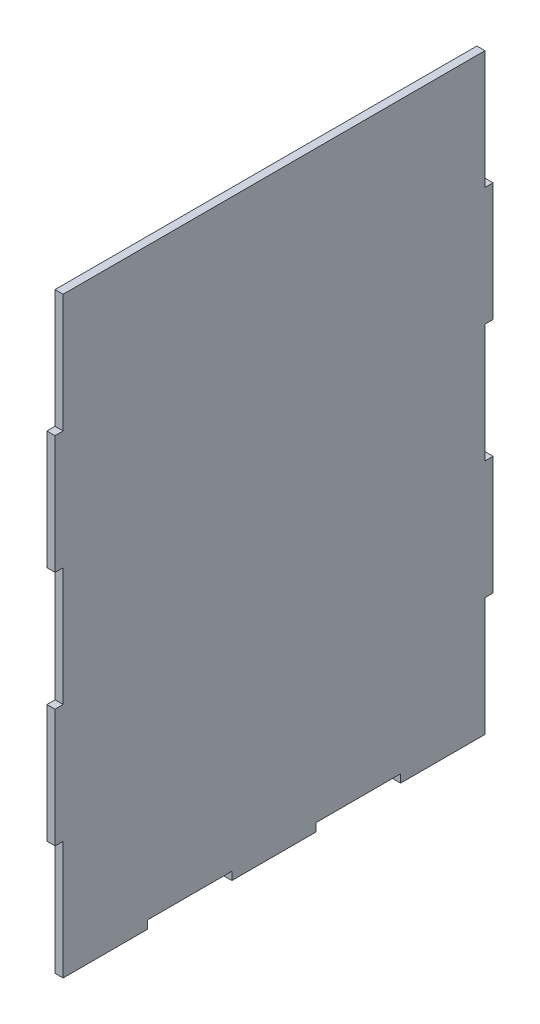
ISO-10303-21;
HEADER;
FILE_DESCRIPTION(('STEP AP214'),'2;1');
FILE_NAME('part.step','',(''),(''),'','','');
FILE_SCHEMA(('AUTOMOTIVE_DESIGN { 1 0 10303 214 1 1 1 1 }'));
ENDSEC;
DATA;
#1=APPLICATION_CONTEXT('core data for automotive mechanical design processes');
#2=APPLICATION_PROTOCOL_DEFINITION('international standard','automotive_design',2000,#1);
#3=PRODUCT_CONTEXT('',#1,'mechanical');
#4=PRODUCT('Part','Part','',(#3));
#5=PRODUCT_RELATED_PRODUCT_CATEGORY('part','',(#4));
#6=PRODUCT_DEFINITION_FORMATION('','',#4);
#7=PRODUCT_DEFINITION_CONTEXT('part definition',#1,'design');
#8=PRODUCT_DEFINITION('design','',#6,#7);
#9=PRODUCT_DEFINITION_SHAPE('','',#8);
#10=(LENGTH_UNIT() NAMED_UNIT(*) SI_UNIT(.MILLI.,.METRE.));
#11=(NAMED_UNIT(*) PLANE_ANGLE_UNIT() SI_UNIT($,.RADIAN.));
#12=(NAMED_UNIT(*) SI_UNIT($,.STERADIAN.) SOLID_ANGLE_UNIT());
#13=UNCERTAINTY_MEASURE_WITH_UNIT(LENGTH_MEASURE(1.E-05),#10,'distance_accuracy_value','');
#14=(GEOMETRIC_REPRESENTATION_CONTEXT(3) GLOBAL_UNCERTAINTY_ASSIGNED_CONTEXT((#13)) GLOBAL_UNIT_ASSIGNED_CONTEXT((#10,
#11,#12)) REPRESENTATION_CONTEXT('',''));
#15=CARTESIAN_POINT('',(0.,0.,0.));
#16=DIRECTION('',(0.,0.,1.));
#17=DIRECTION('',(1.,0.,0.));
#18=AXIS2_PLACEMENT_3D('',#15,#16,#17);
#19=CARTESIAN_POINT('',(0.,-46.355,-171.45));
#20=DIRECTION('',(0.,1.,0.));
#21=DIRECTION('',(0.,0.,1.));
#22=AXIS2_PLACEMENT_3D('',#19,#20,#21);
#23=PLANE('',#22);
#24=DIRECTION('',(0.,0.,1.));
#25=VECTOR('',#24,1.);
#26=CARTESIAN_POINT('',(3.175,-46.355,-171.45));
#27=LINE('',#26,#25);
#28=CARTESIAN_POINT('',(3.175,-46.355,-171.45));
#29=VERTEX_POINT('',#28);
#30=CARTESIAN_POINT('',(3.175,-46.355,-168.275));
#31=VERTEX_POINT('',#30);
#32=EDGE_CURVE('E248',#29,#31,#27,.T.);
#33=ORIENTED_EDGE('',*,*,#32,.F.);
#34=DIRECTION('',(1.,0.,0.));
#35=VECTOR('',#34,1.);
#36=CARTESIAN_POINT('',(0.,-46.355,-171.45));
#37=LINE('',#36,#35);
#38=CARTESIAN_POINT('',(0.,-46.355,-171.45));
#39=VERTEX_POINT('',#38);
#40=EDGE_CURVE('E11',#39,#29,#37,.T.);
#41=ORIENTED_EDGE('',*,*,#40,.F.);
#42=DIRECTION('',(0.,0.,1.));
#43=VECTOR('',#42,1.);
#44=CARTESIAN_POINT('',(0.,-46.355,-171.45));
#45=LINE('',#44,#43);
#46=CARTESIAN_POINT('',(0.,-46.355,-168.275));
#47=VERTEX_POINT('',#46);
#48=EDGE_CURVE('E328',#39,#47,#45,.T.);
#49=ORIENTED_EDGE('',*,*,#48,.T.);
#50=DIRECTION('',(1.,0.,0.));
#51=VECTOR('',#50,1.);
#52=CARTESIAN_POINT('',(0.,-46.355,-168.275));
#53=LINE('',#52,#51);
#54=EDGE_CURVE('E34',#47,#31,#53,.T.);
#55=ORIENTED_EDGE('',*,*,#54,.T.);
#56=EDGE_LOOP('',(#33,#41,#49,#55));
#57=FACE_BOUND('',#56,.T.);
#58=ADVANCED_FACE('F31',(#57),#23,.T.);
#59=CARTESIAN_POINT('',(0.,-92.71,-171.45));
#60=DIRECTION('',(0.,0.,-1.));
#61=DIRECTION('',(-1.,0.,0.));
#62=AXIS2_PLACEMENT_3D('',#59,#60,#61);
#63=PLANE('',#62);
#64=DIRECTION('',(0.,1.,0.));
#65=VECTOR('',#64,1.);
#66=CARTESIAN_POINT('',(3.175,-92.71,-171.45));
#67=LINE('',#66,#65);
#68=CARTESIAN_POINT('',(3.175,-92.71,-171.45));
#69=VERTEX_POINT('',#68);
#70=EDGE_CURVE('E326',#69,#29,#67,.T.);
#71=ORIENTED_EDGE('',*,*,#70,.F.);
#72=DIRECTION('',(1.,0.,0.));
#73=VECTOR('',#72,1.);
#74=CARTESIAN_POINT('',(0.,-92.71,-171.45));
#75=LINE('',#74,#73);
#76=CARTESIAN_POINT('',(0.,-92.71,-171.45));
#77=VERTEX_POINT('',#76);
#78=EDGE_CURVE('E40',#77,#69,#75,.T.);
#79=ORIENTED_EDGE('',*,*,#78,.F.);
#80=DIRECTION('',(0.,1.,0.));
#81=VECTOR('',#80,1.);
#82=CARTESIAN_POINT('',(0.,-92.71,-171.45));
#83=LINE('',#82,#81);
#84=EDGE_CURVE('E238',#77,#39,#83,.T.);
#85=ORIENTED_EDGE('',*,*,#84,.T.);
#86=ORIENTED_EDGE('',*,*,#40,.T.);
#87=EDGE_LOOP('',(#71,#79,#85,#86));
#88=FACE_BOUND('',#87,.T.);
#89=ADVANCED_FACE('F380',(#88),#63,.T.);
#90=CARTESIAN_POINT('',(0.,-92.71,-168.275));
#91=DIRECTION('',(0.,-1.,0.));
#92=DIRECTION('',(0.,0.,-1.));
#93=AXIS2_PLACEMENT_3D('',#90,#91,#92);
#94=PLANE('',#93);
#95=DIRECTION('',(0.,0.,-1.));
#96=VECTOR('',#95,1.);
#97=CARTESIAN_POINT('',(3.175,-92.71,-168.275));
#98=LINE('',#97,#96);
#99=CARTESIAN_POINT('',(3.175,-92.71,-168.275));
#100=VERTEX_POINT('',#99);
#101=EDGE_CURVE('E225',#100,#69,#98,.T.);
#102=ORIENTED_EDGE('',*,*,#101,.F.);
#103=DIRECTION('',(1.,0.,0.));
#104=VECTOR('',#103,1.);
#105=CARTESIAN_POINT('',(0.,-92.71,-168.275));
#106=LINE('',#105,#104);
#107=CARTESIAN_POINT('',(0.,-92.71,-168.275));
#108=VERTEX_POINT('',#107);
#109=EDGE_CURVE('E220',#108,#100,#106,.T.);
#110=ORIENTED_EDGE('',*,*,#109,.F.);
#111=DIRECTION('',(0.,0.,-1.));
#112=VECTOR('',#111,1.);
#113=CARTESIAN_POINT('',(0.,-92.71,-168.275));
#114=LINE('',#113,#112);
#115=EDGE_CURVE('E223',#108,#77,#114,.T.);
#116=ORIENTED_EDGE('',*,*,#115,.T.);
#117=ORIENTED_EDGE('',*,*,#78,.T.);
#118=EDGE_LOOP('',(#102,#110,#116,#117));
#119=FACE_BOUND('',#118,.T.);
#120=ADVANCED_FACE('F222',(#119),#94,.T.);
#121=CARTESIAN_POINT('',(0.,-139.065,-168.275));
#122=DIRECTION('',(0.,0.,-1.));
#123=DIRECTION('',(-1.,0.,0.));
#124=AXIS2_PLACEMENT_3D('',#121,#122,#123);
#125=PLANE('',#124);
#126=DIRECTION('',(0.,1.,0.));
#127=VECTOR('',#126,1.);
#128=CARTESIAN_POINT('',(3.175,-139.065,-168.275));
#129=LINE('',#128,#127);
#130=CARTESIAN_POINT('',(3.175,-139.065,-168.275));
#131=VERTEX_POINT('',#130);
#132=EDGE_CURVE('E323',#131,#100,#129,.T.);
#133=ORIENTED_EDGE('',*,*,#132,.F.);
#134=DIRECTION('',(1.,0.,0.));
#135=VECTOR('',#134,1.);
#136=CARTESIAN_POINT('',(0.,-139.065,-168.275));
#137=LINE('',#136,#135);
#138=CARTESIAN_POINT('',(0.,-139.065,-168.275));
#139=VERTEX_POINT('',#138);
#140=EDGE_CURVE('E230',#139,#131,#137,.T.);
#141=ORIENTED_EDGE('',*,*,#140,.F.);
#142=DIRECTION('',(0.,1.,0.));
#143=VECTOR('',#142,1.);
#144=CARTESIAN_POINT('',(0.,-139.065,-168.275));
#145=LINE('',#144,#143);
#146=EDGE_CURVE('E236',#139,#108,#145,.T.);
#147=ORIENTED_EDGE('',*,*,#146,.T.);
#148=ORIENTED_EDGE('',*,*,#109,.T.);
#149=EDGE_LOOP('',(#133,#141,#147,#148));
#150=FACE_BOUND('',#149,.T.);
#151=ADVANCED_FACE('F240',(#150),#125,.T.);
#152=CARTESIAN_POINT('',(0.,-139.065,-171.45));
#153=DIRECTION('',(0.,1.,0.));
#154=DIRECTION('',(0.,0.,1.));
#155=AXIS2_PLACEMENT_3D('',#152,#153,#154);
#156=PLANE('',#155);
#157=DIRECTION('',(0.,0.,1.));
#158=VECTOR('',#157,1.);
#159=CARTESIAN_POINT('',(3.175,-139.065,-171.45));
#160=LINE('',#159,#158);
#161=CARTESIAN_POINT('',(3.175,-139.065,-171.45));
#162=VERTEX_POINT('',#161);
#163=EDGE_CURVE('E320',#162,#131,#160,.T.);
#164=ORIENTED_EDGE('',*,*,#163,.F.);
#165=DIRECTION('',(1.,0.,0.));
#166=VECTOR('',#165,1.);
#167=CARTESIAN_POINT('',(0.,-139.065,-171.45));
#168=LINE('',#167,#166);
#169=CARTESIAN_POINT('',(0.,-139.065,-171.45));
#170=VERTEX_POINT('',#169);
#171=EDGE_CURVE('E332',#170,#162,#168,.T.);
#172=ORIENTED_EDGE('',*,*,#171,.F.);
#173=DIRECTION('',(0.,0.,1.));
#174=VECTOR('',#173,1.);
#175=CARTESIAN_POINT('',(0.,-139.065,-171.45));
#176=LINE('',#175,#174);
#177=EDGE_CURVE('E241',#170,#139,#176,.T.);
#178=ORIENTED_EDGE('',*,*,#177,.T.);
#179=ORIENTED_EDGE('',*,*,#140,.T.);
#180=EDGE_LOOP('',(#164,#172,#178,#179));
#181=FACE_BOUND('',#180,.T.);
#182=ADVANCED_FACE('F393',(#181),#156,.T.);
#183=CARTESIAN_POINT('',(0.,-185.42,-171.45));
#184=DIRECTION('',(0.,0.,-1.));
#185=DIRECTION('',(-1.,0.,0.));
#186=AXIS2_PLACEMENT_3D('',#183,#184,#185);
#187=PLANE('',#186);
#188=DIRECTION('',(0.,1.,0.));
#189=VECTOR('',#188,1.);
#190=CARTESIAN_POINT('',(3.175,-185.42,-171.45));
#191=LINE('',#190,#189);
#192=CARTESIAN_POINT('',(3.175,-185.42,-171.45));
#193=VERTEX_POINT('',#192);
#194=EDGE_CURVE('E317',#193,#162,#191,.T.);
#195=ORIENTED_EDGE('',*,*,#194,.F.);
#196=DIRECTION('',(1.,0.,0.));
#197=VECTOR('',#196,1.);
#198=CARTESIAN_POINT('',(0.,-185.42,-171.45));
#199=LINE('',#198,#197);
#200=CARTESIAN_POINT('',(0.,-185.42,-171.45));
#201=VERTEX_POINT('',#200);
#202=EDGE_CURVE('E334',#201,#193,#199,.T.);
#203=ORIENTED_EDGE('',*,*,#202,.F.);
#204=DIRECTION('',(0.,1.,0.));
#205=VECTOR('',#204,1.);
#206=CARTESIAN_POINT('',(0.,-185.42,-171.45));
#207=LINE('',#206,#205);
#208=EDGE_CURVE('E243',#201,#170,#207,.T.);
#209=ORIENTED_EDGE('',*,*,#208,.T.);
#210=ORIENTED_EDGE('',*,*,#171,.T.);
#211=EDGE_LOOP('',(#195,#203,#209,#210));
#212=FACE_BOUND('',#211,.T.);
#213=ADVANCED_FACE('F396',(#212),#187,.T.);
#214=CARTESIAN_POINT('',(0.,-185.42,-168.275));
#215=DIRECTION('',(0.,-1.,0.));
#216=DIRECTION('',(0.,0.,-1.));
#217=AXIS2_PLACEMENT_3D('',#214,#215,#216);
#218=PLANE('',#217);
#219=DIRECTION('',(0.,0.,-1.));
#220=VECTOR('',#219,1.);
#221=CARTESIAN_POINT('',(3.175,-185.42,-168.275));
#222=LINE('',#221,#220);
#223=CARTESIAN_POINT('',(3.175,-185.42,-168.275));
#224=VERTEX_POINT('',#223);
#225=EDGE_CURVE('E314',#224,#193,#222,.T.);
#226=ORIENTED_EDGE('',*,*,#225,.F.);
#227=DIRECTION('',(1.,0.,0.));
#228=VECTOR('',#227,1.);
#229=CARTESIAN_POINT('',(0.,-185.42,-168.275));
#230=LINE('',#229,#228);
#231=CARTESIAN_POINT('',(0.,-185.42,-168.275));
#232=VERTEX_POINT('',#231);
#233=EDGE_CURVE('E336',#232,#224,#230,.T.);
#234=ORIENTED_EDGE('',*,*,#233,.F.);
#235=DIRECTION('',(0.,0.,-1.));
#236=VECTOR('',#235,1.);
#237=CARTESIAN_POINT('',(0.,-185.42,-168.275));
#238=LINE('',#237,#236);
#239=EDGE_CURVE('E741',#232,#201,#238,.T.);
#240=ORIENTED_EDGE('',*,*,#239,.T.);
#241=ORIENTED_EDGE('',*,*,#202,.T.);
#242=EDGE_LOOP('',(#226,#234,#240,#241));
#243=FACE_BOUND('',#242,.T.);
#244=ADVANCED_FACE('F400',(#243),#218,.T.);
#245=CARTESIAN_POINT('',(0.,-231.775,-168.275));
#246=DIRECTION('',(0.,0.,-1.));
#247=DIRECTION('',(-1.,0.,0.));
#248=AXIS2_PLACEMENT_3D('',#245,#246,#247);
#249=PLANE('',#248);
#250=DIRECTION('',(0.,1.,0.));
#251=VECTOR('',#250,1.);
#252=CARTESIAN_POINT('',(3.175,-231.775,-168.275));
#253=LINE('',#252,#251);
#254=CARTESIAN_POINT('',(3.175,-231.775,-168.275));
#255=VERTEX_POINT('',#254);
#256=EDGE_CURVE('E311',#255,#224,#253,.T.);
#257=ORIENTED_EDGE('',*,*,#256,.F.);
#258=DIRECTION('',(1.,0.,0.));
#259=VECTOR('',#258,1.);
#260=CARTESIAN_POINT('',(0.,-231.775,-168.275));
#261=LINE('',#260,#259);
#262=CARTESIAN_POINT('',(0.,-231.775,-168.275));
#263=VERTEX_POINT('',#262);
#264=EDGE_CURVE('E338',#263,#255,#261,.T.);
#265=ORIENTED_EDGE('',*,*,#264,.F.);
#266=DIRECTION('',(0.,1.,0.));
#267=VECTOR('',#266,1.);
#268=CARTESIAN_POINT('',(0.,-231.775,-168.275));
#269=LINE('',#268,#267);
#270=EDGE_CURVE('E737',#263,#232,#269,.T.);
#271=ORIENTED_EDGE('',*,*,#270,.T.);
#272=ORIENTED_EDGE('',*,*,#233,.T.);
#273=EDGE_LOOP('',(#257,#265,#271,#272));
#274=FACE_BOUND('',#273,.T.);
#275=ADVANCED_FACE('F404',(#274),#249,.T.);
#276=CARTESIAN_POINT('',(0.,-231.775,-135.255));
#277=DIRECTION('',(0.,-1.,0.));
#278=DIRECTION('',(0.,0.,-1.));
#279=AXIS2_PLACEMENT_3D('',#276,#277,#278);
#280=PLANE('',#279);
#281=DIRECTION('',(0.,0.,-1.));
#282=VECTOR('',#281,1.);
#283=CARTESIAN_POINT('',(3.175,-231.775,-135.255));
#284=LINE('',#283,#282);
#285=CARTESIAN_POINT('',(3.175,-231.775,-135.255));
#286=VERTEX_POINT('',#285);
#287=EDGE_CURVE('E308',#286,#255,#284,.T.);
#288=ORIENTED_EDGE('',*,*,#287,.F.);
#289=DIRECTION('',(1.,0.,0.));
#290=VECTOR('',#289,1.);
#291=CARTESIAN_POINT('',(0.,-231.775,-135.255));
#292=LINE('',#291,#290);
#293=CARTESIAN_POINT('',(0.,-231.775,-135.255));
#294=VERTEX_POINT('',#293);
#295=EDGE_CURVE('E340',#294,#286,#292,.T.);
#296=ORIENTED_EDGE('',*,*,#295,.F.);
#297=DIRECTION('',(0.,0.,-1.));
#298=VECTOR('',#297,1.);
#299=CARTESIAN_POINT('',(0.,-231.775,-135.255));
#300=LINE('',#299,#298);
#301=EDGE_CURVE('E748',#294,#263,#300,.T.);
#302=ORIENTED_EDGE('',*,*,#301,.T.);
#303=ORIENTED_EDGE('',*,*,#264,.T.);
#304=EDGE_LOOP('',(#288,#296,#302,#303));
#305=FACE_BOUND('',#304,.T.);
#306=ADVANCED_FACE('F408',(#305),#280,.T.);
#307=CARTESIAN_POINT('',(0.,-228.6,-135.255));
#308=DIRECTION('',(0.,0.,1.));
#309=DIRECTION('',(1.,0.,0.));
#310=AXIS2_PLACEMENT_3D('',#307,#308,#309);
#311=PLANE('',#310);
#312=DIRECTION('',(0.,-1.,0.));
#313=VECTOR('',#312,1.);
#314=CARTESIAN_POINT('',(3.175,-228.6,-135.255));
#315=LINE('',#314,#313);
#316=CARTESIAN_POINT('',(3.175,-228.6,-135.255));
#317=VERTEX_POINT('',#316);
#318=EDGE_CURVE('E305',#317,#286,#315,.T.);
#319=ORIENTED_EDGE('',*,*,#318,.F.);
#320=DIRECTION('',(1.,0.,0.));
#321=VECTOR('',#320,1.);
#322=CARTESIAN_POINT('',(0.,-228.6,-135.255));
#323=LINE('',#322,#321);
#324=CARTESIAN_POINT('',(0.,-228.6,-135.255));
#325=VERTEX_POINT('',#324);
#326=EDGE_CURVE('E342',#325,#317,#323,.T.);
#327=ORIENTED_EDGE('',*,*,#326,.F.);
#328=DIRECTION('',(0.,-1.,0.));
#329=VECTOR('',#328,1.);
#330=CARTESIAN_POINT('',(0.,-228.6,-135.255));
#331=LINE('',#330,#329);
#332=EDGE_CURVE('E730',#325,#294,#331,.T.);
#333=ORIENTED_EDGE('',*,*,#332,.T.);
#334=ORIENTED_EDGE('',*,*,#295,.T.);
#335=EDGE_LOOP('',(#319,#327,#333,#334));
#336=FACE_BOUND('',#335,.T.);
#337=ADVANCED_FACE('F412',(#336),#311,.T.);
#338=CARTESIAN_POINT('',(0.,-228.6,-102.235));
#339=DIRECTION('',(0.,-1.,0.));
#340=DIRECTION('',(0.,0.,-1.));
#341=AXIS2_PLACEMENT_3D('',#338,#339,#340);
#342=PLANE('',#341);
#343=DIRECTION('',(0.,0.,-1.));
#344=VECTOR('',#343,1.);
#345=CARTESIAN_POINT('',(3.175,-228.6,-102.235));
#346=LINE('',#345,#344);
#347=CARTESIAN_POINT('',(3.175,-228.6,-102.235));
#348=VERTEX_POINT('',#347);
#349=EDGE_CURVE('E302',#348,#317,#346,.T.);
#350=ORIENTED_EDGE('',*,*,#349,.F.);
#351=DIRECTION('',(1.,0.,0.));
#352=VECTOR('',#351,1.);
#353=CARTESIAN_POINT('',(0.,-228.6,-102.235));
#354=LINE('',#353,#352);
#355=CARTESIAN_POINT('',(0.,-228.6,-102.235));
#356=VERTEX_POINT('',#355);
#357=EDGE_CURVE('E344',#356,#348,#354,.T.);
#358=ORIENTED_EDGE('',*,*,#357,.F.);
#359=DIRECTION('',(0.,0.,-1.));
#360=VECTOR('',#359,1.);
#361=CARTESIAN_POINT('',(0.,-228.6,-102.235));
#362=LINE('',#361,#360);
#363=EDGE_CURVE('E726',#356,#325,#362,.T.);
#364=ORIENTED_EDGE('',*,*,#363,.T.);
#365=ORIENTED_EDGE('',*,*,#326,.T.);
#366=EDGE_LOOP('',(#350,#358,#364,#365));
#367=FACE_BOUND('',#366,.T.);
#368=ADVANCED_FACE('F416',(#367),#342,.T.);
#369=CARTESIAN_POINT('',(0.,-231.775,-102.235));
#370=DIRECTION('',(0.,0.,-1.));
#371=DIRECTION('',(-1.,0.,0.));
#372=AXIS2_PLACEMENT_3D('',#369,#370,#371);
#373=PLANE('',#372);
#374=DIRECTION('',(0.,1.,0.));
#375=VECTOR('',#374,1.);
#376=CARTESIAN_POINT('',(3.175,-231.775,-102.235));
#377=LINE('',#376,#375);
#378=CARTESIAN_POINT('',(3.175,-231.775,-102.235));
#379=VERTEX_POINT('',#378);
#380=EDGE_CURVE('E299',#379,#348,#377,.T.);
#381=ORIENTED_EDGE('',*,*,#380,.F.);
#382=DIRECTION('',(1.,0.,0.));
#383=VECTOR('',#382,1.);
#384=CARTESIAN_POINT('',(0.,-231.775,-102.235));
#385=LINE('',#384,#383);
#386=CARTESIAN_POINT('',(0.,-231.775,-102.235));
#387=VERTEX_POINT('',#386);
#388=EDGE_CURVE('E346',#387,#379,#385,.T.);
#389=ORIENTED_EDGE('',*,*,#388,.F.);
#390=DIRECTION('',(0.,1.,0.));
#391=VECTOR('',#390,1.);
#392=CARTESIAN_POINT('',(0.,-231.775,-102.235));
#393=LINE('',#392,#391);
#394=EDGE_CURVE('E752',#387,#356,#393,.T.);
#395=ORIENTED_EDGE('',*,*,#394,.T.);
#396=ORIENTED_EDGE('',*,*,#357,.T.);
#397=EDGE_LOOP('',(#381,#389,#395,#396));
#398=FACE_BOUND('',#397,.T.);
#399=ADVANCED_FACE('F420',(#398),#373,.T.);
#400=CARTESIAN_POINT('',(0.,-231.775,-69.215));
#401=DIRECTION('',(0.,-1.,0.));
#402=DIRECTION('',(0.,0.,-1.));
#403=AXIS2_PLACEMENT_3D('',#400,#401,#402);
#404=PLANE('',#403);
#405=DIRECTION('',(0.,0.,-1.));
#406=VECTOR('',#405,1.);
#407=CARTESIAN_POINT('',(3.175,-231.775,-69.215));
#408=LINE('',#407,#406);
#409=CARTESIAN_POINT('',(3.175,-231.775,-69.215));
#410=VERTEX_POINT('',#409);
#411=EDGE_CURVE('E296',#410,#379,#408,.T.);
#412=ORIENTED_EDGE('',*,*,#411,.F.);
#413=DIRECTION('',(1.,0.,0.));
#414=VECTOR('',#413,1.);
#415=CARTESIAN_POINT('',(0.,-231.775,-69.215));
#416=LINE('',#415,#414);
#417=CARTESIAN_POINT('',(0.,-231.775,-69.215));
#418=VERTEX_POINT('',#417);
#419=EDGE_CURVE('E348',#418,#410,#416,.T.);
#420=ORIENTED_EDGE('',*,*,#419,.F.);
#421=DIRECTION('',(0.,0.,-1.));
#422=VECTOR('',#421,1.);
#423=CARTESIAN_POINT('',(0.,-231.775,-69.215));
#424=LINE('',#423,#422);
#425=EDGE_CURVE('E719',#418,#387,#424,.T.);
#426=ORIENTED_EDGE('',*,*,#425,.T.);
#427=ORIENTED_EDGE('',*,*,#388,.T.);
#428=EDGE_LOOP('',(#412,#420,#426,#427));
#429=FACE_BOUND('',#428,.T.);
#430=ADVANCED_FACE('F424',(#429),#404,.T.);
#431=CARTESIAN_POINT('',(0.,-228.6,-69.215));
#432=DIRECTION('',(0.,0.,1.));
#433=DIRECTION('',(1.,0.,0.));
#434=AXIS2_PLACEMENT_3D('',#431,#432,#433);
#435=PLANE('',#434);
#436=DIRECTION('',(0.,-1.,0.));
#437=VECTOR('',#436,1.);
#438=CARTESIAN_POINT('',(3.175,-228.6,-69.215));
#439=LINE('',#438,#437);
#440=CARTESIAN_POINT('',(3.175,-228.6,-69.215));
#441=VERTEX_POINT('',#440);
#442=EDGE_CURVE('E293',#441,#410,#439,.T.);
#443=ORIENTED_EDGE('',*,*,#442,.F.);
#444=DIRECTION('',(1.,0.,0.));
#445=VECTOR('',#444,1.);
#446=CARTESIAN_POINT('',(0.,-228.6,-69.215));
#447=LINE('',#446,#445);
#448=CARTESIAN_POINT('',(0.,-228.6,-69.215));
#449=VERTEX_POINT('',#448);
#450=EDGE_CURVE('E350',#449,#441,#447,.T.);
#451=ORIENTED_EDGE('',*,*,#450,.F.);
#452=DIRECTION('',(0.,-1.,0.));
#453=VECTOR('',#452,1.);
#454=CARTESIAN_POINT('',(0.,-228.6,-69.215));
#455=LINE('',#454,#453);
#456=EDGE_CURVE('E715',#449,#418,#455,.T.);
#457=ORIENTED_EDGE('',*,*,#456,.T.);
#458=ORIENTED_EDGE('',*,*,#419,.T.);
#459=EDGE_LOOP('',(#443,#451,#457,#458));
#460=FACE_BOUND('',#459,.T.);
#461=ADVANCED_FACE('F428',(#460),#435,.T.);
#462=CARTESIAN_POINT('',(0.,-228.6,-36.195));
#463=DIRECTION('',(0.,-1.,0.));
#464=DIRECTION('',(0.,0.,-1.));
#465=AXIS2_PLACEMENT_3D('',#462,#463,#464);
#466=PLANE('',#465);
#467=DIRECTION('',(0.,0.,-1.));
#468=VECTOR('',#467,1.);
#469=CARTESIAN_POINT('',(3.175,-228.6,-36.195));
#470=LINE('',#469,#468);
#471=CARTESIAN_POINT('',(3.175,-228.6,-36.195));
#472=VERTEX_POINT('',#471);
#473=EDGE_CURVE('E290',#472,#441,#470,.T.);
#474=ORIENTED_EDGE('',*,*,#473,.F.);
#475=DIRECTION('',(1.,0.,0.));
#476=VECTOR('',#475,1.);
#477=CARTESIAN_POINT('',(0.,-228.6,-36.195));
#478=LINE('',#477,#476);
#479=CARTESIAN_POINT('',(0.,-228.6,-36.195));
#480=VERTEX_POINT('',#479);
#481=EDGE_CURVE('E352',#480,#472,#478,.T.);
#482=ORIENTED_EDGE('',*,*,#481,.F.);
#483=DIRECTION('',(0.,0.,-1.));
#484=VECTOR('',#483,1.);
#485=CARTESIAN_POINT('',(0.,-228.6,-36.195));
#486=LINE('',#485,#484);
#487=EDGE_CURVE('E756',#480,#449,#486,.T.);
#488=ORIENTED_EDGE('',*,*,#487,.T.);
#489=ORIENTED_EDGE('',*,*,#450,.T.);
#490=EDGE_LOOP('',(#474,#482,#488,#489));
#491=FACE_BOUND('',#490,.T.);
#492=ADVANCED_FACE('F432',(#491),#466,.T.);
#493=CARTESIAN_POINT('',(0.,-231.775,-36.195));
#494=DIRECTION('',(0.,0.,-1.));
#495=DIRECTION('',(-1.,0.,0.));
#496=AXIS2_PLACEMENT_3D('',#493,#494,#495);
#497=PLANE('',#496);
#498=DIRECTION('',(0.,1.,0.));
#499=VECTOR('',#498,1.);
#500=CARTESIAN_POINT('',(3.175,-231.775,-36.195));
#501=LINE('',#500,#499);
#502=CARTESIAN_POINT('',(3.175,-231.775,-36.195));
#503=VERTEX_POINT('',#502);
#504=EDGE_CURVE('E287',#503,#472,#501,.T.);
#505=ORIENTED_EDGE('',*,*,#504,.F.);
#506=DIRECTION('',(1.,0.,0.));
#507=VECTOR('',#506,1.);
#508=CARTESIAN_POINT('',(0.,-231.775,-36.195));
#509=LINE('',#508,#507);
#510=CARTESIAN_POINT('',(0.,-231.775,-36.195));
#511=VERTEX_POINT('',#510);
#512=EDGE_CURVE('E354',#511,#503,#509,.T.);
#513=ORIENTED_EDGE('',*,*,#512,.F.);
#514=DIRECTION('',(0.,1.,0.));
#515=VECTOR('',#514,1.);
#516=CARTESIAN_POINT('',(0.,-231.775,-36.195));
#517=LINE('',#516,#515);
#518=EDGE_CURVE('E708',#511,#480,#517,.T.);
#519=ORIENTED_EDGE('',*,*,#518,.T.);
#520=ORIENTED_EDGE('',*,*,#481,.T.);
#521=EDGE_LOOP('',(#505,#513,#519,#520));
#522=FACE_BOUND('',#521,.T.);
#523=ADVANCED_FACE('F436',(#522),#497,.T.);
#524=CARTESIAN_POINT('',(0.,-231.775,-3.175));
#525=DIRECTION('',(0.,-1.,0.));
#526=DIRECTION('',(0.,0.,-1.));
#527=AXIS2_PLACEMENT_3D('',#524,#525,#526);
#528=PLANE('',#527);
#529=DIRECTION('',(0.,0.,-1.));
#530=VECTOR('',#529,1.);
#531=CARTESIAN_POINT('',(3.175,-231.775,-3.175));
#532=LINE('',#531,#530);
#533=CARTESIAN_POINT('',(3.175,-231.775,-3.175));
#534=VERTEX_POINT('',#533);
#535=EDGE_CURVE('E284',#534,#503,#532,.T.);
#536=ORIENTED_EDGE('',*,*,#535,.F.);
#537=DIRECTION('',(1.,0.,0.));
#538=VECTOR('',#537,1.);
#539=CARTESIAN_POINT('',(0.,-231.775,-3.175));
#540=LINE('',#539,#538);
#541=CARTESIAN_POINT('',(0.,-231.775,-3.175));
#542=VERTEX_POINT('',#541);
#543=EDGE_CURVE('E356',#542,#534,#540,.T.);
#544=ORIENTED_EDGE('',*,*,#543,.F.);
#545=DIRECTION('',(0.,0.,-1.));
#546=VECTOR('',#545,1.);
#547=CARTESIAN_POINT('',(0.,-231.775,-3.175));
#548=LINE('',#547,#546);
#549=EDGE_CURVE('E704',#542,#511,#548,.T.);
#550=ORIENTED_EDGE('',*,*,#549,.T.);
#551=ORIENTED_EDGE('',*,*,#512,.T.);
#552=EDGE_LOOP('',(#536,#544,#550,#551));
#553=FACE_BOUND('',#552,.T.);
#554=ADVANCED_FACE('F440',(#553),#528,.T.);
#555=CARTESIAN_POINT('',(0.,-185.42,-3.175));
#556=DIRECTION('',(0.,0.,1.));
#557=DIRECTION('',(1.,0.,0.));
#558=AXIS2_PLACEMENT_3D('',#555,#556,#557);
#559=PLANE('',#558);
#560=DIRECTION('',(0.,-1.,0.));
#561=VECTOR('',#560,1.);
#562=CARTESIAN_POINT('',(3.175,-185.42,-3.175));
#563=LINE('',#562,#561);
#564=CARTESIAN_POINT('',(3.175,-185.42,-3.175));
#565=VERTEX_POINT('',#564);
#566=EDGE_CURVE('E281',#565,#534,#563,.T.);
#567=ORIENTED_EDGE('',*,*,#566,.F.);
#568=DIRECTION('',(1.,0.,0.));
#569=VECTOR('',#568,1.);
#570=CARTESIAN_POINT('',(0.,-185.42,-3.175));
#571=LINE('',#570,#569);
#572=CARTESIAN_POINT('',(0.,-185.42,-3.175));
#573=VERTEX_POINT('',#572);
#574=EDGE_CURVE('E358',#573,#565,#571,.T.);
#575=ORIENTED_EDGE('',*,*,#574,.F.);
#576=DIRECTION('',(0.,-1.,0.));
#577=VECTOR('',#576,1.);
#578=CARTESIAN_POINT('',(0.,-185.42,-3.175));
#579=LINE('',#578,#577);
#580=EDGE_CURVE('E760',#573,#542,#579,.T.);
#581=ORIENTED_EDGE('',*,*,#580,.T.);
#582=ORIENTED_EDGE('',*,*,#543,.T.);
#583=EDGE_LOOP('',(#567,#575,#581,#582));
#584=FACE_BOUND('',#583,.T.);
#585=ADVANCED_FACE('F444',(#584),#559,.T.);
#586=CARTESIAN_POINT('',(0.,-185.42,0.));
#587=DIRECTION('',(0.,-1.,0.));
#588=DIRECTION('',(0.,0.,-1.));
#589=AXIS2_PLACEMENT_3D('',#586,#587,#588);
#590=PLANE('',#589);
#591=DIRECTION('',(0.,0.,-1.));
#592=VECTOR('',#591,1.);
#593=CARTESIAN_POINT('',(3.175,-185.42,0.));
#594=LINE('',#593,#592);
#595=CARTESIAN_POINT('',(3.175,-185.42,0.));
#596=VERTEX_POINT('',#595);
#597=EDGE_CURVE('E278',#596,#565,#594,.T.);
#598=ORIENTED_EDGE('',*,*,#597,.F.);
#599=DIRECTION('',(1.,0.,0.));
#600=VECTOR('',#599,1.);
#601=CARTESIAN_POINT('',(0.,-185.42,0.));
#602=LINE('',#601,#600);
#603=CARTESIAN_POINT('',(0.,-185.42,0.));
#604=VERTEX_POINT('',#603);
#605=EDGE_CURVE('E360',#604,#596,#602,.T.);
#606=ORIENTED_EDGE('',*,*,#605,.F.);
#607=DIRECTION('',(0.,0.,-1.));
#608=VECTOR('',#607,1.);
#609=CARTESIAN_POINT('',(0.,-185.42,0.));
#610=LINE('',#609,#608);
#611=EDGE_CURVE('E697',#604,#573,#610,.T.);
#612=ORIENTED_EDGE('',*,*,#611,.T.);
#613=ORIENTED_EDGE('',*,*,#574,.T.);
#614=EDGE_LOOP('',(#598,#606,#612,#613));
#615=FACE_BOUND('',#614,.T.);
#616=ADVANCED_FACE('F448',(#615),#590,.T.);
#617=CARTESIAN_POINT('',(0.,-139.065,0.));
#618=DIRECTION('',(0.,0.,1.));
#619=DIRECTION('',(1.,0.,0.));
#620=AXIS2_PLACEMENT_3D('',#617,#618,#619);
#621=PLANE('',#620);
#622=DIRECTION('',(0.,-1.,0.));
#623=VECTOR('',#622,1.);
#624=CARTESIAN_POINT('',(3.175,-139.065,0.));
#625=LINE('',#624,#623);
#626=CARTESIAN_POINT('',(3.175,-139.065,0.));
#627=VERTEX_POINT('',#626);
#628=EDGE_CURVE('E275',#627,#596,#625,.T.);
#629=ORIENTED_EDGE('',*,*,#628,.F.);
#630=DIRECTION('',(1.,0.,0.));
#631=VECTOR('',#630,1.);
#632=CARTESIAN_POINT('',(0.,-139.065,0.));
#633=LINE('',#632,#631);
#634=CARTESIAN_POINT('',(0.,-139.065,0.));
#635=VERTEX_POINT('',#634);
#636=EDGE_CURVE('E362',#635,#627,#633,.T.);
#637=ORIENTED_EDGE('',*,*,#636,.F.);
#638=DIRECTION('',(0.,-1.,0.));
#639=VECTOR('',#638,1.);
#640=CARTESIAN_POINT('',(0.,-139.065,0.));
#641=LINE('',#640,#639);
#642=EDGE_CURVE('E693',#635,#604,#641,.T.);
#643=ORIENTED_EDGE('',*,*,#642,.T.);
#644=ORIENTED_EDGE('',*,*,#605,.T.);
#645=EDGE_LOOP('',(#629,#637,#643,#644));
#646=FACE_BOUND('',#645,.T.);
#647=ADVANCED_FACE('F452',(#646),#621,.T.);
#648=CARTESIAN_POINT('',(0.,-139.065,-3.175));
#649=DIRECTION('',(0.,1.,0.));
#650=DIRECTION('',(0.,0.,1.));
#651=AXIS2_PLACEMENT_3D('',#648,#649,#650);
#652=PLANE('',#651);
#653=DIRECTION('',(0.,0.,1.));
#654=VECTOR('',#653,1.);
#655=CARTESIAN_POINT('',(3.175,-139.065,-3.175));
#656=LINE('',#655,#654);
#657=CARTESIAN_POINT('',(3.175,-139.065,-3.175));
#658=VERTEX_POINT('',#657);
#659=EDGE_CURVE('E272',#658,#627,#656,.T.);
#660=ORIENTED_EDGE('',*,*,#659,.F.);
#661=DIRECTION('',(1.,0.,0.));
#662=VECTOR('',#661,1.);
#663=CARTESIAN_POINT('',(0.,-139.065,-3.175));
#664=LINE('',#663,#662);
#665=CARTESIAN_POINT('',(0.,-139.065,-3.175));
#666=VERTEX_POINT('',#665);
#667=EDGE_CURVE('E364',#666,#658,#664,.T.);
#668=ORIENTED_EDGE('',*,*,#667,.F.);
#669=DIRECTION('',(0.,0.,1.));
#670=VECTOR('',#669,1.);
#671=CARTESIAN_POINT('',(0.,-139.065,-3.175));
#672=LINE('',#671,#670);
#673=EDGE_CURVE('E764',#666,#635,#672,.T.);
#674=ORIENTED_EDGE('',*,*,#673,.T.);
#675=ORIENTED_EDGE('',*,*,#636,.T.);
#676=EDGE_LOOP('',(#660,#668,#674,#675));
#677=FACE_BOUND('',#676,.T.);
#678=ADVANCED_FACE('F456',(#677),#652,.T.);
#679=CARTESIAN_POINT('',(0.,-92.71,-3.175));
#680=DIRECTION('',(0.,0.,1.));
#681=DIRECTION('',(1.,0.,0.));
#682=AXIS2_PLACEMENT_3D('',#679,#680,#681);
#683=PLANE('',#682);
#684=DIRECTION('',(0.,-1.,0.));
#685=VECTOR('',#684,1.);
#686=CARTESIAN_POINT('',(3.175,-92.71,-3.175));
#687=LINE('',#686,#685);
#688=CARTESIAN_POINT('',(3.175,-92.71,-3.175));
#689=VERTEX_POINT('',#688);
#690=EDGE_CURVE('E269',#689,#658,#687,.T.);
#691=ORIENTED_EDGE('',*,*,#690,.F.);
#692=DIRECTION('',(1.,0.,0.));
#693=VECTOR('',#692,1.);
#694=CARTESIAN_POINT('',(0.,-92.71,-3.175));
#695=LINE('',#694,#693);
#696=CARTESIAN_POINT('',(0.,-92.71,-3.175));
#697=VERTEX_POINT('',#696);
#698=EDGE_CURVE('E366',#697,#689,#695,.T.);
#699=ORIENTED_EDGE('',*,*,#698,.F.);
#700=DIRECTION('',(0.,-1.,0.));
#701=VECTOR('',#700,1.);
#702=CARTESIAN_POINT('',(0.,-92.71,-3.175));
#703=LINE('',#702,#701);
#704=EDGE_CURVE('E686',#697,#666,#703,.T.);
#705=ORIENTED_EDGE('',*,*,#704,.T.);
#706=ORIENTED_EDGE('',*,*,#667,.T.);
#707=EDGE_LOOP('',(#691,#699,#705,#706));
#708=FACE_BOUND('',#707,.T.);
#709=ADVANCED_FACE('F460',(#708),#683,.T.);
#710=CARTESIAN_POINT('',(0.,-92.71,0.));
#711=DIRECTION('',(0.,-1.,0.));
#712=DIRECTION('',(0.,0.,-1.));
#713=AXIS2_PLACEMENT_3D('',#710,#711,#712);
#714=PLANE('',#713);
#715=DIRECTION('',(0.,0.,-1.));
#716=VECTOR('',#715,1.);
#717=CARTESIAN_POINT('',(3.175,-92.71,0.));
#718=LINE('',#717,#716);
#719=CARTESIAN_POINT('',(3.175,-92.71,0.));
#720=VERTEX_POINT('',#719);
#721=EDGE_CURVE('E266',#720,#689,#718,.T.);
#722=ORIENTED_EDGE('',*,*,#721,.F.);
#723=DIRECTION('',(1.,0.,0.));
#724=VECTOR('',#723,1.);
#725=CARTESIAN_POINT('',(0.,-92.71,0.));
#726=LINE('',#725,#724);
#727=CARTESIAN_POINT('',(0.,-92.71,0.));
#728=VERTEX_POINT('',#727);
#729=EDGE_CURVE('E368',#728,#720,#726,.T.);
#730=ORIENTED_EDGE('',*,*,#729,.F.);
#731=DIRECTION('',(0.,0.,-1.));
#732=VECTOR('',#731,1.);
#733=CARTESIAN_POINT('',(0.,-92.71,0.));
#734=LINE('',#733,#732);
#735=EDGE_CURVE('E682',#728,#697,#734,.T.);
#736=ORIENTED_EDGE('',*,*,#735,.T.);
#737=ORIENTED_EDGE('',*,*,#698,.T.);
#738=EDGE_LOOP('',(#722,#730,#736,#737));
#739=FACE_BOUND('',#738,.T.);
#740=ADVANCED_FACE('F464',(#739),#714,.T.);
#741=CARTESIAN_POINT('',(0.,-46.355,0.));
#742=DIRECTION('',(0.,0.,1.));
#743=DIRECTION('',(1.,0.,0.));
#744=AXIS2_PLACEMENT_3D('',#741,#742,#743);
#745=PLANE('',#744);
#746=DIRECTION('',(0.,-1.,0.));
#747=VECTOR('',#746,1.);
#748=CARTESIAN_POINT('',(3.175,-46.355,0.));
#749=LINE('',#748,#747);
#750=CARTESIAN_POINT('',(3.175,-46.355,0.));
#751=VERTEX_POINT('',#750);
#752=EDGE_CURVE('E263',#751,#720,#749,.T.);
#753=ORIENTED_EDGE('',*,*,#752,.F.);
#754=DIRECTION('',(1.,0.,0.));
#755=VECTOR('',#754,1.);
#756=CARTESIAN_POINT('',(0.,-46.355,0.));
#757=LINE('',#756,#755);
#758=CARTESIAN_POINT('',(0.,-46.355,0.));
#759=VERTEX_POINT('',#758);
#760=EDGE_CURVE('E370',#759,#751,#757,.T.);
#761=ORIENTED_EDGE('',*,*,#760,.F.);
#762=DIRECTION('',(0.,-1.,0.));
#763=VECTOR('',#762,1.);
#764=CARTESIAN_POINT('',(0.,-46.355,0.));
#765=LINE('',#764,#763);
#766=EDGE_CURVE('E768',#759,#728,#765,.T.);
#767=ORIENTED_EDGE('',*,*,#766,.T.);
#768=ORIENTED_EDGE('',*,*,#729,.T.);
#769=EDGE_LOOP('',(#753,#761,#767,#768));
#770=FACE_BOUND('',#769,.T.);
#771=ADVANCED_FACE('F468',(#770),#745,.T.);
#772=CARTESIAN_POINT('',(0.,-46.355,-3.175));
#773=DIRECTION('',(0.,1.,0.));
#774=DIRECTION('',(0.,0.,1.));
#775=AXIS2_PLACEMENT_3D('',#772,#773,#774);
#776=PLANE('',#775);
#777=DIRECTION('',(0.,0.,1.));
#778=VECTOR('',#777,1.);
#779=CARTESIAN_POINT('',(3.175,-46.355,-3.175));
#780=LINE('',#779,#778);
#781=CARTESIAN_POINT('',(3.175,-46.355,-3.175));
#782=VERTEX_POINT('',#781);
#783=EDGE_CURVE('E260',#782,#751,#780,.T.);
#784=ORIENTED_EDGE('',*,*,#783,.F.);
#785=DIRECTION('',(1.,0.,0.));
#786=VECTOR('',#785,1.);
#787=CARTESIAN_POINT('',(0.,-46.355,-3.175));
#788=LINE('',#787,#786);
#789=CARTESIAN_POINT('',(0.,-46.355,-3.175));
#790=VERTEX_POINT('',#789);
#791=EDGE_CURVE('E372',#790,#782,#788,.T.);
#792=ORIENTED_EDGE('',*,*,#791,.F.);
#793=DIRECTION('',(0.,0.,1.));
#794=VECTOR('',#793,1.);
#795=CARTESIAN_POINT('',(0.,-46.355,-3.175));
#796=LINE('',#795,#794);
#797=EDGE_CURVE('E675',#790,#759,#796,.T.);
#798=ORIENTED_EDGE('',*,*,#797,.T.);
#799=ORIENTED_EDGE('',*,*,#760,.T.);
#800=EDGE_LOOP('',(#784,#792,#798,#799));
#801=FACE_BOUND('',#800,.T.);
#802=ADVANCED_FACE('F472',(#801),#776,.T.);
#803=CARTESIAN_POINT('',(0.,0.,-3.175));
#804=DIRECTION('',(0.,0.,1.));
#805=DIRECTION('',(0.,-1.,0.));
#806=AXIS2_PLACEMENT_3D('',#803,#804,#805);
#807=PLANE('',#806);
#808=DIRECTION('',(0.,-1.,0.));
#809=VECTOR('',#808,1.);
#810=CARTESIAN_POINT('',(3.175,0.,-3.175));
#811=LINE('',#810,#809);
#812=CARTESIAN_POINT('',(3.175,0.,-3.175));
#813=VERTEX_POINT('',#812);
#814=EDGE_CURVE('E257',#813,#782,#811,.T.);
#815=ORIENTED_EDGE('',*,*,#814,.F.);
#816=DIRECTION('',(1.,0.,0.));
#817=VECTOR('',#816,1.);
#818=CARTESIAN_POINT('',(0.,0.,-3.175));
#819=LINE('',#818,#817);
#820=CARTESIAN_POINT('',(0.,0.,-3.175));
#821=VERTEX_POINT('',#820);
#822=EDGE_CURVE('E374',#821,#813,#819,.T.);
#823=ORIENTED_EDGE('',*,*,#822,.F.);
#824=DIRECTION('',(0.,-1.,0.));
#825=VECTOR('',#824,1.);
#826=CARTESIAN_POINT('',(0.,0.,-3.175));
#827=LINE('',#826,#825);
#828=EDGE_CURVE('E671',#821,#790,#827,.T.);
#829=ORIENTED_EDGE('',*,*,#828,.T.);
#830=ORIENTED_EDGE('',*,*,#791,.T.);
#831=EDGE_LOOP('',(#815,#823,#829,#830));
#832=FACE_BOUND('',#831,.T.);
#833=ADVANCED_FACE('F476',(#832),#807,.T.);
#834=CARTESIAN_POINT('',(0.,0.,-168.275));
#835=DIRECTION('',(0.,1.,0.));
#836=DIRECTION('',(0.,0.,1.));
#837=AXIS2_PLACEMENT_3D('',#834,#835,#836);
#838=PLANE('',#837);
#839=DIRECTION('',(0.,0.,1.));
#840=VECTOR('',#839,1.);
#841=CARTESIAN_POINT('',(3.175,0.,-168.275));
#842=LINE('',#841,#840);
#843=CARTESIAN_POINT('',(3.175,0.,-168.275));
#844=VERTEX_POINT('',#843);
#845=EDGE_CURVE('E254',#844,#813,#842,.T.);
#846=ORIENTED_EDGE('',*,*,#845,.F.);
#847=DIRECTION('',(1.,0.,0.));
#848=VECTOR('',#847,1.);
#849=CARTESIAN_POINT('',(0.,0.,-168.275));
#850=LINE('',#849,#848);
#851=CARTESIAN_POINT('',(0.,0.,-168.275));
#852=VERTEX_POINT('',#851);
#853=EDGE_CURVE('E375',#852,#844,#850,.T.);
#854=ORIENTED_EDGE('',*,*,#853,.F.);
#855=DIRECTION('',(0.,0.,1.));
#856=VECTOR('',#855,1.);
#857=CARTESIAN_POINT('',(0.,0.,-168.275));
#858=LINE('',#857,#856);
#859=EDGE_CURVE('E772',#852,#821,#858,.T.);
#860=ORIENTED_EDGE('',*,*,#859,.T.);
#861=ORIENTED_EDGE('',*,*,#822,.T.);
#862=EDGE_LOOP('',(#846,#854,#860,#861));
#863=FACE_BOUND('',#862,.T.);
#864=ADVANCED_FACE('F480',(#863),#838,.T.);
#865=CARTESIAN_POINT('',(0.,-46.355,-168.275));
#866=DIRECTION('',(0.,0.,-1.));
#867=DIRECTION('',(-1.,0.,0.));
#868=AXIS2_PLACEMENT_3D('',#865,#866,#867);
#869=PLANE('',#868);
#870=DIRECTION('',(0.,1.,0.));
#871=VECTOR('',#870,1.);
#872=CARTESIAN_POINT('',(3.175,-46.355,-168.275));
#873=LINE('',#872,#871);
#874=EDGE_CURVE('E251',#31,#844,#873,.T.);
#875=ORIENTED_EDGE('',*,*,#874,.F.);
#876=ORIENTED_EDGE('',*,*,#54,.F.);
#877=DIRECTION('',(0.,1.,0.));
#878=VECTOR('',#877,1.);
#879=CARTESIAN_POINT('',(0.,-46.355,-168.275));
#880=LINE('',#879,#878);
#881=EDGE_CURVE('E774',#47,#852,#880,.T.);
#882=ORIENTED_EDGE('',*,*,#881,.T.);
#883=ORIENTED_EDGE('',*,*,#853,.T.);
#884=EDGE_LOOP('',(#875,#876,#882,#883));
#885=FACE_BOUND('',#884,.T.);
#886=ADVANCED_FACE('F377',(#885),#869,.T.);
#887=CARTESIAN_POINT('',(0.,-46.355,-168.275));
#888=DIRECTION('',(-1.,0.,0.));
#889=DIRECTION('',(0.,0.,1.));
#890=AXIS2_PLACEMENT_3D('',#887,#888,#889);
#891=PLANE('',#890);
#892=ORIENTED_EDGE('',*,*,#48,.F.);
#893=ORIENTED_EDGE('',*,*,#84,.F.);
#894=ORIENTED_EDGE('',*,*,#115,.F.);
#895=ORIENTED_EDGE('',*,*,#146,.F.);
#896=ORIENTED_EDGE('',*,*,#177,.F.);
#897=ORIENTED_EDGE('',*,*,#208,.F.);
#898=ORIENTED_EDGE('',*,*,#239,.F.);
#899=ORIENTED_EDGE('',*,*,#270,.F.);
#900=ORIENTED_EDGE('',*,*,#301,.F.);
#901=ORIENTED_EDGE('',*,*,#332,.F.);
#902=ORIENTED_EDGE('',*,*,#363,.F.);
#903=ORIENTED_EDGE('',*,*,#394,.F.);
#904=ORIENTED_EDGE('',*,*,#425,.F.);
#905=ORIENTED_EDGE('',*,*,#456,.F.);
#906=ORIENTED_EDGE('',*,*,#487,.F.);
#907=ORIENTED_EDGE('',*,*,#518,.F.);
#908=ORIENTED_EDGE('',*,*,#549,.F.);
#909=ORIENTED_EDGE('',*,*,#580,.F.);
#910=ORIENTED_EDGE('',*,*,#611,.F.);
#911=ORIENTED_EDGE('',*,*,#642,.F.);
#912=ORIENTED_EDGE('',*,*,#673,.F.);
#913=ORIENTED_EDGE('',*,*,#704,.F.);
#914=ORIENTED_EDGE('',*,*,#735,.F.);
#915=ORIENTED_EDGE('',*,*,#766,.F.);
#916=ORIENTED_EDGE('',*,*,#797,.F.);
#917=ORIENTED_EDGE('',*,*,#828,.F.);
#918=ORIENTED_EDGE('',*,*,#859,.F.);
#919=ORIENTED_EDGE('',*,*,#881,.F.);
#920=EDGE_LOOP('',(#892,#893,#894,#895,#896,#897,#898,#899,#900,#901,#902,#903,#904,#905,#906,
#907,#908,#909,#910,#911,#912,#913,#914,#915,#916,#917,#918,#919));
#921=FACE_BOUND('',#920,.T.);
#922=ADVANCED_FACE('F234',(#921),#891,.T.);
#923=CARTESIAN_POINT('',(3.175,-46.355,-168.275));
#924=DIRECTION('',(-1.,0.,0.));
#925=DIRECTION('',(0.,0.,1.));
#926=AXIS2_PLACEMENT_3D('',#923,#924,#925);
#927=PLANE('',#926);
#928=ORIENTED_EDGE('',*,*,#32,.T.);
#929=ORIENTED_EDGE('',*,*,#874,.T.);
#930=ORIENTED_EDGE('',*,*,#845,.T.);
#931=ORIENTED_EDGE('',*,*,#814,.T.);
#932=ORIENTED_EDGE('',*,*,#783,.T.);
#933=ORIENTED_EDGE('',*,*,#752,.T.);
#934=ORIENTED_EDGE('',*,*,#721,.T.);
#935=ORIENTED_EDGE('',*,*,#690,.T.);
#936=ORIENTED_EDGE('',*,*,#659,.T.);
#937=ORIENTED_EDGE('',*,*,#628,.T.);
#938=ORIENTED_EDGE('',*,*,#597,.T.);
#939=ORIENTED_EDGE('',*,*,#566,.T.);
#940=ORIENTED_EDGE('',*,*,#535,.T.);
#941=ORIENTED_EDGE('',*,*,#504,.T.);
#942=ORIENTED_EDGE('',*,*,#473,.T.);
#943=ORIENTED_EDGE('',*,*,#442,.T.);
#944=ORIENTED_EDGE('',*,*,#411,.T.);
#945=ORIENTED_EDGE('',*,*,#380,.T.);
#946=ORIENTED_EDGE('',*,*,#349,.T.);
#947=ORIENTED_EDGE('',*,*,#318,.T.);
#948=ORIENTED_EDGE('',*,*,#287,.T.);
#949=ORIENTED_EDGE('',*,*,#256,.T.);
#950=ORIENTED_EDGE('',*,*,#225,.T.);
#951=ORIENTED_EDGE('',*,*,#194,.T.);
#952=ORIENTED_EDGE('',*,*,#163,.T.);
#953=ORIENTED_EDGE('',*,*,#132,.T.);
#954=ORIENTED_EDGE('',*,*,#101,.T.);
#955=ORIENTED_EDGE('',*,*,#70,.T.);
#956=EDGE_LOOP('',(#928,#929,#930,#931,#932,#933,#934,#935,#936,#937,#938,#939,#940,#941,#942,
#943,#944,#945,#946,#947,#948,#949,#950,#951,#952,#953,#954,#955));
#957=FACE_BOUND('',#956,.T.);
#958=ADVANCED_FACE('F379',(#957),#927,.F.);
#959=CLOSED_SHELL('',(#58,#89,#120,#151,#182,#213,#244,#275,#306,#337,#368,#399,#430,#461,#492,
#523,#554,#585,#616,#647,#678,#709,#740,#771,#802,#833,#864,#886,#922,#958));
#960=MANIFOLD_SOLID_BREP('B2',#959);
#961=ADVANCED_BREP_SHAPE_REPRESENTATION('',(#18,#960),#14);
#962=SHAPE_DEFINITION_REPRESENTATION(#9,#961);
ENDSEC;
END-ISO-10303-21;
